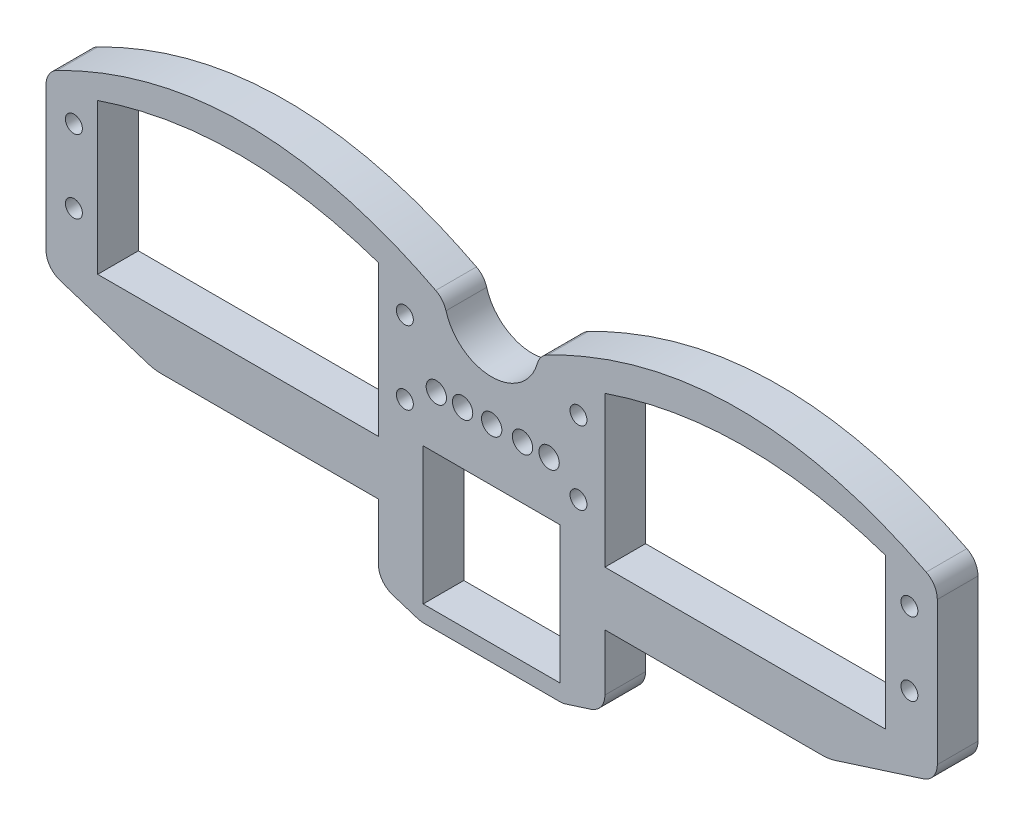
from build123d import *

# Parameters (mm, degrees)
SKETCH1_R           = 1.25
SKETCH1_W           = 20.2
SKETCH1_H           = 20.2
BOSS_EXTRUDE1_DEPTH = 6
SKETCH2_R           = 1.5
CUT_EXTRUDE1_DEPTH  = 6
SKETCH3_R           = 1.5
CUT_EXTRUDE2_DEPTH  = 15


with BuildPart() as part:
    # Sketch1 → Boss-Extrude1 (new body)
    with BuildSketch(Plane.XY):
        with BuildLine():
            Line((-293.05420593, 31.078656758), (-293.05420593, 12.798580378))
            Line((-293.05420593, 12.798580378), (-293.05420593, 9.991002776))
            ThreePointArc((-293.05420593, 9.991002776), (-292.476335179, 8.220892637), (-290.965345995, 7.132712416))
            Line((-290.965345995, 7.132712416), (-277.944359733, 2.981999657))
            ThreePointArc((-277.944359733, 2.981999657), (-277.044173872, 2.769858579), (-276.122079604, 2.698580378))
            Line((-276.122079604, 2.698580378), (-244.039056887, 2.698580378))
            Line((-244.039056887, 2.698580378), (-244.039056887, -5.633605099))
            ThreePointArc((-244.039056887, -5.633605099), (-243.461186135, -7.403715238), (-241.950196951, -8.491895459))
            Line((-241.950196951, -8.491895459), (-238.286706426, -9.659709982))
            ThreePointArc((-238.286706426, -9.659709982), (-237.836613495, -9.765780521), (-237.375566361, -9.801419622))
            Line((-237.375566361, -9.801419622), (-217.30874653, -9.801419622))
            ThreePointArc((-217.30874653, -9.801419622), (-216.847699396, -9.765780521), (-216.397606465, -9.659709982))
            Line((-216.397606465, -9.659709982), (-212.734115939, -8.491895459))
            ThreePointArc((-212.734115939, -8.491895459), (-211.223126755, -7.403715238), (-210.645256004, -5.633605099))
            Line((-210.645256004, -5.633605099), (-210.645256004, 2.698580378))
            Line((-210.645256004, 2.698580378), (-178.562233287, 2.698580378))
            ThreePointArc((-178.562233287, 2.698580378), (-177.640139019, 2.769858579), (-176.739953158, 2.981999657))
            Line((-176.739953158, 2.981999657), (-163.718966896, 7.132712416))
            ThreePointArc((-163.718966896, 7.132712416), (-162.207977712, 8.220892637), (-161.630106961, 9.991002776))
            Line((-161.630106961, 9.991002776), (-161.630106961, 12.798580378))
            Line((-161.630106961, 12.798580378), (-161.630106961, 31.078656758))
            ThreePointArc((-161.630106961, 31.078656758), (-162.073356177, 32.648059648), (-163.272123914, 33.753704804))
            add(Edge.make_bspline(
                [(-163.272123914, 33.753704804), (-172.45079135, 38.413237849), (-191.07337937, 43.162730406), (-209.666506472, 38.412169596), (-219.095969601, 33.571011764)],
                knots=[0.027970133, 0.027970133, 0.027970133, 0.027970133, 0.497008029, 0.978120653, 0.978120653, 0.978120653, 0.978120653], degree=3))
            ThreePointArc((-219.095969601, 33.571011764), (-220.044887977, 32.805281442), (-220.610692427, 31.725163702))
            ThreePointArc((-220.610692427, 31.725163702), (-227.342156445, 26.645422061), (-234.073620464, 31.725163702))
            ThreePointArc((-234.073620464, 31.725163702), (-234.639424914, 32.805281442), (-235.58834329, 33.571011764))
            add(Edge.make_bspline(
                [(-291.412188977, 33.753704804), (-282.233521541, 38.413237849), (-263.610933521, 43.162730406), (-245.017806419, 38.412169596), (-235.58834329, 33.571011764)],
                knots=[0.027970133, 0.027970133, 0.027970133, 0.027970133, 0.497008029, 0.978120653, 0.978120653, 0.978120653, 0.978120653], degree=3))
            ThreePointArc((-291.412188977, 33.753704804), (-292.610956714, 32.648059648), (-293.05420593, 31.078656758))
        make_face()
        with Locations((-288.942156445, 28.165422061)):
            Circle(SKETCH1_R, mode=Mode.SUBTRACT)
        with Locations((-288.942156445, 17.375422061)):
            Circle(SKETCH1_R, mode=Mode.SUBTRACT)
        with Locations((-240.142156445, 28.165422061)):
            Circle(SKETCH1_R, mode=Mode.SUBTRACT)
        with Locations((-240.142156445, 17.375422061)):
            Circle(SKETCH1_R, mode=Mode.SUBTRACT)
        with Locations((-214.542156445, 28.165422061)):
            Circle(SKETCH1_R, mode=Mode.SUBTRACT)
        with Locations((-214.542156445, 17.375422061)):
            Circle(SKETCH1_R, mode=Mode.SUBTRACT)
        with Locations((-165.742156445, 28.165422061)):
            Circle(SKETCH1_R, mode=Mode.SUBTRACT)
        with Locations((-165.742156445, 17.375422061)):
            Circle(SKETCH1_R, mode=Mode.SUBTRACT)
        with Locations((-227.342156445, 2.698580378)):
            Rectangle(SKETCH1_W, SKETCH1_H, mode=Mode.SUBTRACT)
        with BuildLine():
            Line((-285.432745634, 32.895422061), (-285.432745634, 10.698580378))
            Line((-285.432745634, 10.698580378), (-244.039056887, 10.698580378))
            Line((-244.039056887, 10.698580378), (-244.039056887, 32.895422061))
            add(Edge.make_bspline(
                [(-244.039056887, 32.895422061), (-264.686191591, 39.947412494), (-285.432745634, 32.895422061)],
                knots=[0, 0, 0, 1, 1, 1], degree=2))
        make_face(mode=Mode.SUBTRACT)
        with BuildLine():
            Line((-210.645256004, 10.698580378), (-210.645256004, 32.895422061))
            add(Edge.make_bspline(
                [(-210.645256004, 32.895422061), (-189.9981213, 39.947412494), (-169.251567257, 32.895422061)],
                knots=[0, 0, 0, 1, 1, 1], degree=2))
            Line((-169.251567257, 32.895422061), (-169.251567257, 10.698580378))
            Line((-169.251567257, 10.698580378), (-210.645256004, 10.698580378))
        make_face(mode=Mode.SUBTRACT)
    extrude(amount=BOSS_EXTRUDE1_DEPTH)

    # Sketch2 → Cut-Extrude1 (cut)
    with BuildSketch(Plane.XY.offset(6)):
        with Locations((-227.342156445, 20.607774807)):
            Circle(SKETCH2_R)
        with Locations((-235.502710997, 20.607774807)):
            Circle(SKETCH2_R)
        with Locations((-218.871269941, 20.607774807)):
            Circle(SKETCH2_R)
    extrude(amount=-CUT_EXTRUDE1_DEPTH, mode=Mode.SUBTRACT)

    # Sketch3 → Cut-Extrude2 (cut)
    with BuildSketch(Plane.XY.offset(6)):
        with Locations((-231.62762591, 20.607774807)):
            Circle(SKETCH3_R)
        with Locations((-222.79035574, 20.607774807)):
            Circle(SKETCH3_R)
    extrude(amount=-CUT_EXTRUDE2_DEPTH, mode=Mode.SUBTRACT)


solid = part.part
